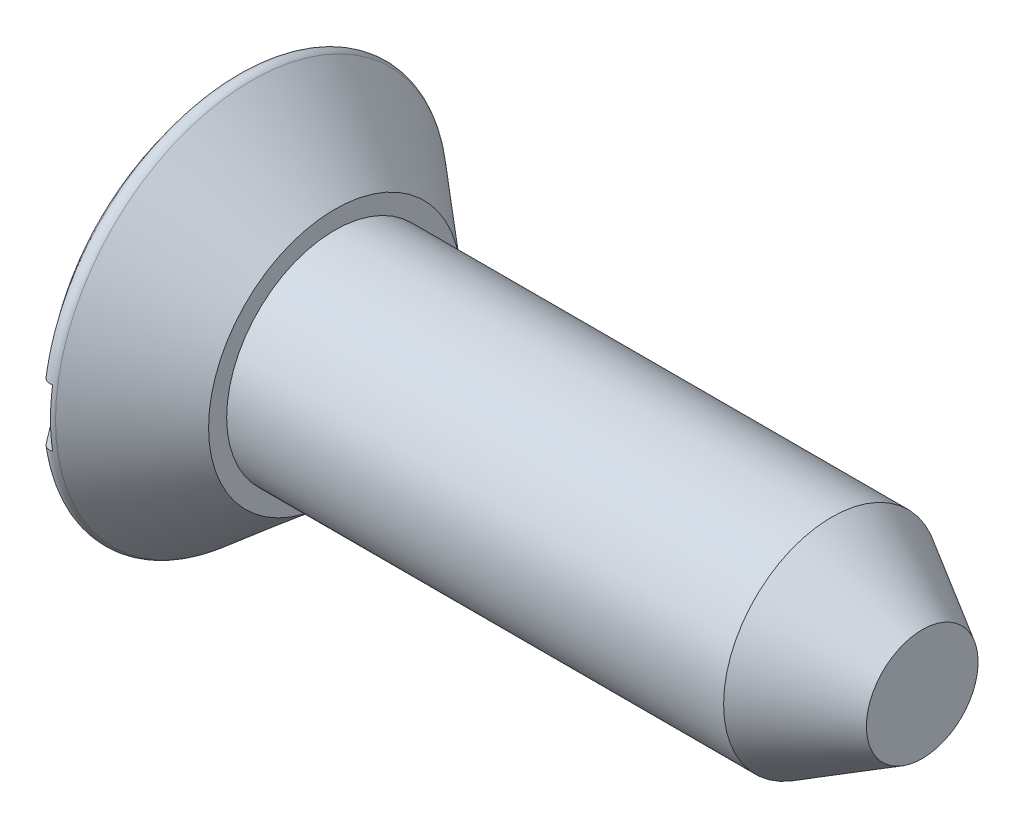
ISO-10303-21;
HEADER;
FILE_DESCRIPTION(('STEP AP214'),'2;1');
FILE_NAME('part.step','',(''),(''),'','','');
FILE_SCHEMA(('AUTOMOTIVE_DESIGN { 1 0 10303 214 1 1 1 1 }'));
ENDSEC;
DATA;
#1=APPLICATION_CONTEXT('core data for automotive mechanical design processes');
#2=APPLICATION_PROTOCOL_DEFINITION('international standard','automotive_design',2000,#1);
#3=PRODUCT_CONTEXT('',#1,'mechanical');
#4=PRODUCT('Part','Part','',(#3));
#5=PRODUCT_RELATED_PRODUCT_CATEGORY('part','',(#4));
#6=PRODUCT_DEFINITION_FORMATION('','',#4);
#7=PRODUCT_DEFINITION_CONTEXT('part definition',#1,'design');
#8=PRODUCT_DEFINITION('design','',#6,#7);
#9=PRODUCT_DEFINITION_SHAPE('','',#8);
#10=(LENGTH_UNIT() NAMED_UNIT(*) SI_UNIT(.MILLI.,.METRE.));
#11=(NAMED_UNIT(*) PLANE_ANGLE_UNIT() SI_UNIT($,.RADIAN.));
#12=(NAMED_UNIT(*) SI_UNIT($,.STERADIAN.) SOLID_ANGLE_UNIT());
#13=UNCERTAINTY_MEASURE_WITH_UNIT(LENGTH_MEASURE(1.E-05),#10,'distance_accuracy_value','');
#14=(GEOMETRIC_REPRESENTATION_CONTEXT(3) GLOBAL_UNCERTAINTY_ASSIGNED_CONTEXT((#13)) GLOBAL_UNIT_ASSIGNED_CONTEXT((#10,
#11,#12)) REPRESENTATION_CONTEXT('',''));
#15=CARTESIAN_POINT('',(0.,0.,0.));
#16=DIRECTION('',(0.,0.,1.));
#17=DIRECTION('',(1.,0.,0.));
#18=AXIS2_PLACEMENT_3D('',#15,#16,#17);
#19=CARTESIAN_POINT('',(0.,0.,0.));
#20=DIRECTION('',(-1.,0.,0.));
#21=DIRECTION('',(0.,0.,1.));
#22=AXIS2_PLACEMENT_3D('',#19,#20,#21);
#23=CYLINDRICAL_SURFACE('',#22,0.762);
#24=CARTESIAN_POINT('',(0.635,0.,0.));
#25=DIRECTION('',(-1.,0.,0.));
#26=DIRECTION('',(0.,0.,1.));
#27=AXIS2_PLACEMENT_3D('',#24,#25,#26);
#28=CIRCLE('',#27,0.762);
#29=CARTESIAN_POINT('',(0.635,0.,0.762));
#30=VERTEX_POINT('',#29);
#31=EDGE_CURVE('E164',#30,#30,#28,.T.);
#32=ORIENTED_EDGE('',*,*,#31,.F.);
#33=EDGE_LOOP('',(#32));
#34=FACE_BOUND('',#33,.T.);
#35=CARTESIAN_POINT('',(4.13728568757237,0.,0.));
#36=DIRECTION('',(-1.,0.,0.));
#37=DIRECTION('',(0.,0.,1.));
#38=AXIS2_PLACEMENT_3D('',#35,#36,#37);
#39=CIRCLE('',#38,0.762);
#40=CARTESIAN_POINT('',(4.13728568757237,0.,0.762));
#41=VERTEX_POINT('',#40);
#42=EDGE_CURVE('E194',#41,#41,#39,.T.);
#43=ORIENTED_EDGE('',*,*,#42,.T.);
#44=EDGE_LOOP('',(#43));
#45=FACE_BOUND('',#44,.T.);
#46=ADVANCED_FACE('F76',(#34,#45),#23,.T.);
#47=CARTESIAN_POINT('',(1.62983333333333,0.,0.));
#48=DIRECTION('',(-1.,0.,0.));
#49=DIRECTION('',(0.,1.,0.));
#50=AXIS2_PLACEMENT_3D('',#47,#48,#49);
#51=SPHERICAL_SURFACE('',#50,2.16323333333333);
#52=CARTESIAN_POINT('',(-0.0414603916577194,0.,0.));
#53=DIRECTION('',(-1.,0.,0.));
#54=DIRECTION('',(0.,0.,1.));
#55=AXIS2_PLACEMENT_3D('',#52,#53,#54);
#56=CIRCLE('',#55,1.37344666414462);
#57=CARTESIAN_POINT('',(-0.0414603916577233,0.2032,1.35833188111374));
#58=VERTEX_POINT('',#57);
#59=CARTESIAN_POINT('',(-0.0414603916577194,0.2032,-1.35833188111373));
#60=VERTEX_POINT('',#59);
#61=EDGE_CURVE('E174',#58,#60,#56,.T.);
#62=ORIENTED_EDGE('',*,*,#61,.T.);
#63=CARTESIAN_POINT('',(1.62983333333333,0.2032,0.));
#64=DIRECTION('',(0.,1.,0.));
#65=DIRECTION('',(0.,0.,1.));
#66=AXIS2_PLACEMENT_3D('',#63,#64,#65);
#67=CIRCLE('',#66,2.15366854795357);
#68=EDGE_CURVE('E104',#60,#58,#67,.T.);
#69=ORIENTED_EDGE('',*,*,#68,.T.);
#70=EDGE_LOOP('',(#62,#69));
#71=FACE_BOUND('',#70,.T.);
#72=ADVANCED_FACE('F190',(#71),#51,.T.);
#73=CARTESIAN_POINT('',(-0.0414603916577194,-0.2032,-1.35833188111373));
#74=VERTEX_POINT('',#73);
#75=CARTESIAN_POINT('',(-0.0414603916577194,-0.2032,1.35833188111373));
#76=VERTEX_POINT('',#75);
#77=EDGE_CURVE('E141',#74,#76,#56,.T.);
#78=ORIENTED_EDGE('',*,*,#77,.T.);
#79=CARTESIAN_POINT('',(1.62983333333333,-0.2032,0.));
#80=DIRECTION('',(0.,-1.,0.));
#81=DIRECTION('',(0.,0.,-1.));
#82=AXIS2_PLACEMENT_3D('',#79,#80,#81);
#83=CIRCLE('',#82,2.15366854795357);
#84=EDGE_CURVE('E96',#76,#74,#83,.T.);
#85=ORIENTED_EDGE('',*,*,#84,.T.);
#86=EDGE_LOOP('',(#78,#85));
#87=FACE_BOUND('',#86,.T.);
#88=ADVANCED_FACE('F78',(#87),#51,.T.);
#89=CARTESIAN_POINT('',(0.635,0.889571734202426,0.));
#90=DIRECTION('',(-1.,0.,0.));
#91=DIRECTION('',(0.,0.,1.));
#92=AXIS2_PLACEMENT_3D('',#89,#90,#91);
#93=PLANE('',#92);
#94=CARTESIAN_POINT('',(0.635,0.,0.));
#95=DIRECTION('',(-1.,0.,0.));
#96=DIRECTION('',(0.,0.,1.));
#97=AXIS2_PLACEMENT_3D('',#94,#95,#96);
#98=CIRCLE('',#97,0.889571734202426);
#99=CARTESIAN_POINT('',(0.635,0.,0.889571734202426));
#100=VERTEX_POINT('',#99);
#101=EDGE_CURVE('E179',#100,#100,#98,.T.);
#102=ORIENTED_EDGE('',*,*,#101,.F.);
#103=EDGE_LOOP('',(#102));
#104=FACE_BOUND('',#103,.T.);
#105=ORIENTED_EDGE('',*,*,#31,.T.);
#106=EDGE_LOOP('',(#105));
#107=FACE_BOUND('',#106,.T.);
#108=ADVANCED_FACE('F186',(#104,#107),#93,.F.);
#109=CARTESIAN_POINT('',(0.635,0.,0.));
#110=DIRECTION('',(-1.,0.,0.));
#111=DIRECTION('',(0.,0.,1.));
#112=AXIS2_PLACEMENT_3D('',#109,#110,#111);
#113=CONICAL_SURFACE('',#112,0.889571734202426,0.698131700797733);
#114=CARTESIAN_POINT('',(0.0484161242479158,0.,0.));
#115=DIRECTION('',(-1.,0.,0.));
#116=DIRECTION('',(0.,0.,1.));
#117=AXIS2_PLACEMENT_3D('',#114,#115,#116);
#118=CIRCLE('',#117,1.38177404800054);
#119=CARTESIAN_POINT('',(0.0484161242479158,0.,1.38177404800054));
#120=VERTEX_POINT('',#119);
#121=EDGE_CURVE('E177',#120,#120,#118,.T.);
#122=ORIENTED_EDGE('',*,*,#121,.F.);
#123=EDGE_LOOP('',(#122));
#124=FACE_BOUND('',#123,.T.);
#125=ORIENTED_EDGE('',*,*,#101,.T.);
#126=EDGE_LOOP('',(#125));
#127=FACE_BOUND('',#126,.T.);
#128=ADVANCED_FACE('F208',(#124,#127),#113,.T.);
#129=CARTESIAN_POINT('',(0.00759911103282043,0.,0.));
#130=DIRECTION('',(-1.,0.,0.));
#131=DIRECTION('',(0.,0.,1.));
#132=AXIS2_PLACEMENT_3D('',#129,#130,#131);
#133=TOROIDAL_SURFACE('',#132,1.33313022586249,0.0635000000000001);
#134=CARTESIAN_POINT('',(0.0253999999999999,0.,0.));
#135=DIRECTION('',(1.,0.,0.));
#136=DIRECTION('',(0.,0.,-1.));
#137=AXIS2_PLACEMENT_3D('',#134,#135,#136);
#138=CIRCLE('',#137,1.39408412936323);
#139=CARTESIAN_POINT('',(0.0253999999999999,-0.2032,-1.37919553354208));
#140=VERTEX_POINT('',#139);
#141=CARTESIAN_POINT('',(0.0253999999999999,0.2032,-1.37919553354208));
#142=VERTEX_POINT('',#141);
#143=EDGE_CURVE('E89',#140,#142,#138,.T.);
#144=ORIENTED_EDGE('',*,*,#143,.T.);
#145=CARTESIAN_POINT('',(-0.0280765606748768,0.2032,-1.37068105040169));
#146=CARTESIAN_POINT('',(-0.0310388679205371,0.2032,-1.36864704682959));
#147=CARTESIAN_POINT('',(-0.0338302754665,0.2032,-1.36635921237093));
#148=CARTESIAN_POINT('',(-0.0389903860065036,0.2032,-1.36134417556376));
#149=CARTESIAN_POINT('',(-0.0413585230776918,0.2032,-1.35861639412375));
#150=CARTESIAN_POINT('',(-0.0456025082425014,0.2032,-1.35280526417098));
#151=CARTESIAN_POINT('',(-0.0474788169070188,0.2032,-1.34972225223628));
#152=CARTESIAN_POINT('',(-0.0506912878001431,0.2032,-1.34328786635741));
#153=CARTESIAN_POINT('',(-0.0520275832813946,0.2032,-1.3399365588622));
#154=CARTESIAN_POINT('',(-0.0541344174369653,0.2032,-1.33303161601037));
#155=CARTESIAN_POINT('',(-0.0549004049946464,0.2032,-1.32947659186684));
#156=CARTESIAN_POINT('',(-0.0558294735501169,0.2032,-1.32228842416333));
#157=CARTESIAN_POINT('',(-0.0559925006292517,0.2032,-1.31865527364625));
#158=CARTESIAN_POINT('',(-0.0557106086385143,0.2032,-1.31138620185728));
#159=CARTESIAN_POINT('',(-0.0552612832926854,0.2032,-1.30775045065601));
#160=CARTESIAN_POINT('',(-0.0537590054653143,0.2032,-1.30060577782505));
#161=CARTESIAN_POINT('',(-0.0527060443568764,0.2032,-1.29709685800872));
#162=CARTESIAN_POINT('',(-0.0500240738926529,0.2032,-1.2903045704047));
#163=CARTESIAN_POINT('',(-0.0483948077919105,0.2032,-1.28702130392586));
#164=CARTESIAN_POINT('',(-0.0446044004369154,0.2032,-1.28077753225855));
#165=CARTESIAN_POINT('',(-0.0424432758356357,0.2032,-1.27781701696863));
#166=CARTESIAN_POINT('',(-0.0376660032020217,0.2032,-1.27232642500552));
#167=CARTESIAN_POINT('',(-0.0350532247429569,0.2032,-1.26979341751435));
#168=CARTESIAN_POINT('',(-0.029435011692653,0.2032,-1.26520842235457));
#169=CARTESIAN_POINT('',(-0.0264296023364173,0.2032,-1.26315640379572));
#170=CARTESIAN_POINT('',(-0.0201498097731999,0.2032,-1.25961788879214));
#171=CARTESIAN_POINT('',(-0.0168790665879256,0.2032,-1.2581249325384));
#172=CARTESIAN_POINT('',(-0.0101314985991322,0.2032,-1.25571637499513));
#173=CARTESIAN_POINT('',(-0.00665468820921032,0.2032,-1.2548007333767));
#174=CARTESIAN_POINT('',(0.000364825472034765,0.2032,-1.25358223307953));
#175=CARTESIAN_POINT('',(0.00390636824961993,0.2032,-1.25327268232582));
#176=CARTESIAN_POINT('',(0.0109908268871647,0.2032,-1.2532556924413));
#177=CARTESIAN_POINT('',(0.0145337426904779,0.2032,-1.25354823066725));
#178=CARTESIAN_POINT('',(0.0215028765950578,0.2032,-1.25472350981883));
#179=CARTESIAN_POINT('',(0.024929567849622,0.2032,-1.25560344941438));
#180=CARTESIAN_POINT('',(0.0315874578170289,0.2032,-1.2579239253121));
#181=CARTESIAN_POINT('',(0.0348186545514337,0.2032,-1.25936446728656));
#182=CARTESIAN_POINT('',(0.0410084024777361,0.2032,-1.26276984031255));
#183=CARTESIAN_POINT('',(0.0439658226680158,0.2032,-1.26473672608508));
#184=CARTESIAN_POINT('',(0.0495129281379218,0.2032,-1.26913422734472));
#185=CARTESIAN_POINT('',(0.0521025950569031,0.2032,-1.2715648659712));
#186=CARTESIAN_POINT('',(0.0568703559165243,0.2032,-1.27684798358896));
#187=CARTESIAN_POINT('',(0.0590438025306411,0.2032,-1.27970465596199));
#188=CARTESIAN_POINT('',(0.0628870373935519,0.2032,-1.28573874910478));
#189=CARTESIAN_POINT('',(0.0645567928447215,0.2032,-1.28891619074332));
#190=CARTESIAN_POINT('',(0.0673659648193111,0.2032,-1.29554283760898));
#191=CARTESIAN_POINT('',(0.0684987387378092,0.2032,-1.29899485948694));
#192=CARTESIAN_POINT('',(0.0701738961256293,0.2032,-1.30603933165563));
#193=CARTESIAN_POINT('',(0.0707162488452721,0.2032,-1.30963178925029));
#194=CARTESIAN_POINT('',(0.0711980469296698,0.2032,-1.31688608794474));
#195=CARTESIAN_POINT('',(0.0711326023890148,0.2032,-1.32054825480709));
#196=CARTESIAN_POINT('',(0.0703883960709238,0.2032,-1.32780981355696));
#197=CARTESIAN_POINT('',(0.0697096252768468,0.2032,-1.33140920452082));
#198=CARTESIAN_POINT('',(0.0677556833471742,0.2032,-1.33844529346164));
#199=CARTESIAN_POINT('',(0.0664800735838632,0.2032,-1.34188186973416));
#200=CARTESIAN_POINT('',(0.0633663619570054,0.2032,-1.34849009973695));
#201=CARTESIAN_POINT('',(0.0615282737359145,0.2032,-1.35166175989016));
#202=CARTESIAN_POINT('',(0.0573534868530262,0.2032,-1.35762753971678));
#203=CARTESIAN_POINT('',(0.0550200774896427,0.2032,-1.36042396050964));
#204=CARTESIAN_POINT('',(0.0499123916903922,0.2032,-1.36558019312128));
#205=CARTESIAN_POINT('',(0.0471381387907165,0.2032,-1.36794002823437));
#206=CARTESIAN_POINT('',(0.041258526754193,0.2032,-1.37212965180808));
#207=CARTESIAN_POINT('',(0.0381569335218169,0.2032,-1.37396472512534));
#208=CARTESIAN_POINT('',(0.0316874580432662,0.2032,-1.37708192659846));
#209=CARTESIAN_POINT('',(0.0283196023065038,0.2032,-1.3783641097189));
#210=CARTESIAN_POINT('',(0.0214497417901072,0.2032,-1.38032643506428));
#211=CARTESIAN_POINT('',(0.0179494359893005,0.2032,-1.38101252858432));
#212=CARTESIAN_POINT('',(0.0108822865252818,0.2032,-1.38178380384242));
#213=CARTESIAN_POINT('',(0.00731542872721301,0.2032,-1.38186885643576));
#214=CARTESIAN_POINT('',(0.00023700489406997,0.2032,-1.38143643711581));
#215=CARTESIAN_POINT('',(-0.00327474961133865,0.2032,-1.38092201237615));
#216=CARTESIAN_POINT('',(-0.0101589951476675,0.2032,-1.37931130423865));
#217=CARTESIAN_POINT('',(-0.0135316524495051,0.2032,-1.37821573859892));
#218=CARTESIAN_POINT('',(-0.0187672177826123,0.2032,-1.37601485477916));
#219=CARTESIAN_POINT('',(-0.0207041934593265,0.2032,-1.37508132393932));
#220=CARTESIAN_POINT('',(-0.0244733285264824,0.2032,-1.3730224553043));
#221=CARTESIAN_POINT('',(-0.0263054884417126,0.2032,-1.37189711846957));
#222=CARTESIAN_POINT('',(-0.0280765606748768,0.2032,-1.37068105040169));
#223=B_SPLINE_CURVE_WITH_KNOTS('',3,(#145,#146,#147,#148,#149,#150,#151,#152,#153,#154,#155,
#156,#157,#158,#159,#160,#161,#162,#163,#164,#165,#166,#167,#168,#169,#170,#171,#172,#173,#174,
#175,#176,#177,#178,#179,#180,#181,#182,#183,#184,#185,#186,#187,#188,#189,#190,#191,#192,#193,
#194,#195,#196,#197,#198,#199,#200,#201,#202,#203,#204,#205,#206,#207,#208,#209,#210,#211,#212,
#213,#214,#215,#216,#217,#218,#219,#220,#221,#222),.UNSPECIFIED.,.T.,.F.,(4,2,2,2,2,2,2,2,2,2,2,
2,2,2,2,2,2,2,2,2,2,2,2,2,2,2,2,2,2,2,2,2,2,2,2,2,2,2,4),(0.,0.0107722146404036,
0.021558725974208,0.0323350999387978,0.0431088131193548,0.0539676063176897,0.0648273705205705,
0.0757656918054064,0.0867041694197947,0.0976475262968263,0.108590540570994,0.119455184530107,
0.130319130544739,0.141053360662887,0.151786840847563,0.162401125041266,0.173015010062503,
0.18357863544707,0.194142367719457,0.204747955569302,0.215354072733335,0.226072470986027,
0.236791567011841,0.247640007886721,0.258489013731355,0.26942537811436,0.280361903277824,
0.291306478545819,0.302250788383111,0.313124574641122,0.323997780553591,0.334757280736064,
0.34551571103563,0.356165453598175,0.366817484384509,0.377415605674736,0.388000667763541,
0.394441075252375,0.40088145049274),.UNSPECIFIED.);
#224=EDGE_CURVE('E49',#142,#60,#223,.T.);
#225=ORIENTED_EDGE('',*,*,#224,.T.);
#226=ORIENTED_EDGE('',*,*,#61,.F.);
#227=CARTESIAN_POINT('',(0.00947622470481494,0.2032,1.25329211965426));
#228=CARTESIAN_POINT('',(0.00594649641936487,0.2032,1.25318653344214));
#229=CARTESIAN_POINT('',(0.00240523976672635,0.2032,1.2533798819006));
#230=CARTESIAN_POINT('',(-0.00459708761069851,0.2032,1.25435998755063));
#231=CARTESIAN_POINT('',(-0.00805805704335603,0.2032,1.25514745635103));
#232=CARTESIAN_POINT('',(-0.0147964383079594,0.2032,1.257291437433));
#233=CARTESIAN_POINT('',(-0.0180739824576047,0.2032,1.25864753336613));
#234=CARTESIAN_POINT('',(-0.0243556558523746,0.2032,1.26188748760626));
#235=CARTESIAN_POINT('',(-0.0273598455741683,0.2032,1.26377122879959));
#236=CARTESIAN_POINT('',(-0.0330294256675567,0.2032,1.26802277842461));
#237=CARTESIAN_POINT('',(-0.0356928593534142,0.2032,1.27039319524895));
#238=CARTESIAN_POINT('',(-0.0405898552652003,0.2032,1.27554288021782));
#239=CARTESIAN_POINT('',(-0.0428233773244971,0.2032,1.27832218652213));
#240=CARTESIAN_POINT('',(-0.0468253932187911,0.2032,1.28424605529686));
#241=CARTESIAN_POINT('',(-0.048588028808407,0.2032,1.28739457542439));
#242=CARTESIAN_POINT('',(-0.0515663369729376,0.2032,1.29394046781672));
#243=CARTESIAN_POINT('',(-0.0527819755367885,0.2032,1.29733785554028));
#244=CARTESIAN_POINT('',(-0.0546447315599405,0.2032,1.30432511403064));
#245=CARTESIAN_POINT('',(-0.0552854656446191,0.2032,1.30791668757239));
#246=CARTESIAN_POINT('',(-0.0559583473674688,0.2032,1.31515644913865));
#247=CARTESIAN_POINT('',(-0.0559904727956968,0.2032,1.3188046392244));
#248=CARTESIAN_POINT('',(-0.0554434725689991,0.2032,1.32607408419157));
#249=CARTESIAN_POINT('',(-0.0548611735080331,0.2032,1.32969510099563));
#250=CARTESIAN_POINT('',(-0.0530954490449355,0.2032,1.33678758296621));
#251=CARTESIAN_POINT('',(-0.0519120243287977,0.2032,1.34025904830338));
#252=CARTESIAN_POINT('',(-0.0489792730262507,0.2032,1.34694386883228));
#253=CARTESIAN_POINT('',(-0.0472313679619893,0.2032,1.35015784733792));
#254=CARTESIAN_POINT('',(-0.0432163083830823,0.2032,1.35624332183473));
#255=CARTESIAN_POINT('',(-0.0409491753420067,0.2032,1.35911483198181));
#256=CARTESIAN_POINT('',(-0.0359804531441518,0.2032,1.36440678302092));
#257=CARTESIAN_POINT('',(-0.0332827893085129,0.2032,1.36683090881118));
#258=CARTESIAN_POINT('',(-0.0275149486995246,0.2032,1.37118587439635));
#259=CARTESIAN_POINT('',(-0.0244447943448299,0.2032,1.37311674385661));
#260=CARTESIAN_POINT('',(-0.0180548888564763,0.2032,1.37640840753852));
#261=CARTESIAN_POINT('',(-0.0147382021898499,0.2032,1.37777515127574));
#262=CARTESIAN_POINT('',(-0.00792123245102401,0.2032,1.37992697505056));
#263=CARTESIAN_POINT('',(-0.00442095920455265,0.2032,1.38071208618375));
#264=CARTESIAN_POINT('',(0.00263179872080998,0.2032,1.38167253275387));
#265=CARTESIAN_POINT('',(0.00618358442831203,0.2032,1.38185300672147));
#266=CARTESIAN_POINT('',(0.0132667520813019,0.2032,1.38161315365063));
#267=CARTESIAN_POINT('',(0.016798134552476,0.2032,1.38119284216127));
#268=CARTESIAN_POINT('',(0.0237296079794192,0.2032,1.37976626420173));
#269=CARTESIAN_POINT('',(0.0271300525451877,0.2032,1.37876171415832));
#270=CARTESIAN_POINT('',(0.0337149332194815,0.2032,1.37619803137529));
#271=CARTESIAN_POINT('',(0.0368993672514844,0.2032,1.37463889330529));
#272=CARTESIAN_POINT('',(0.0429751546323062,0.2032,1.37100526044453));
#273=CARTESIAN_POINT('',(0.0458653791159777,0.2032,1.36892887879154));
#274=CARTESIAN_POINT('',(0.0512601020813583,0.2032,1.364324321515));
#275=CARTESIAN_POINT('',(0.0537645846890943,0.2032,1.36179612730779));
#276=CARTESIAN_POINT('',(0.0583409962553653,0.2032,1.35633601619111));
#277=CARTESIAN_POINT('',(0.0604088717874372,0.2032,1.35340070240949));
#278=CARTESIAN_POINT('',(0.0640286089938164,0.2032,1.34722755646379));
#279=CARTESIAN_POINT('',(0.0655804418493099,0.2032,1.34398970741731));
#280=CARTESIAN_POINT('',(0.0681413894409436,0.2032,1.3372661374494));
#281=CARTESIAN_POINT('',(0.06914449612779,0.2032,1.33377812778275));
#282=CARTESIAN_POINT('',(0.0705562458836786,0.2032,1.32668378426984));
#283=CARTESIAN_POINT('',(0.0709648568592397,0.2032,1.32307744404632));
#284=CARTESIAN_POINT('',(0.0711781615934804,0.2032,1.31581706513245));
#285=CARTESIAN_POINT('',(0.0709778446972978,0.2032,1.31216287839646));
#286=CARTESIAN_POINT('',(0.0699679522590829,0.2032,1.30493959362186));
#287=CARTESIAN_POINT('',(0.0691583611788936,0.2032,1.30137049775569));
#288=CARTESIAN_POINT('',(0.0669493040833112,0.2032,1.29441170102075));
#289=CARTESIAN_POINT('',(0.0655486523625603,0.2032,1.29102237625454));
#290=CARTESIAN_POINT('',(0.0621951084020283,0.2032,1.28452895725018));
#291=CARTESIAN_POINT('',(0.0602422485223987,0.2032,1.28142484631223));
#292=CARTESIAN_POINT('',(0.0558506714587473,0.2032,1.27561016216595));
#293=CARTESIAN_POINT('',(0.053414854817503,0.2032,1.27289739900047));
#294=CARTESIAN_POINT('',(0.0481169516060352,0.2032,1.26792439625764));
#295=CARTESIAN_POINT('',(0.0452547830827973,0.2032,1.265664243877));
#296=CARTESIAN_POINT('',(0.0392195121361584,0.2032,1.26168837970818));
#297=CARTESIAN_POINT('',(0.0360501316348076,0.2032,1.25996701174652));
#298=CARTESIAN_POINT('',(0.0294673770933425,0.2032,1.25709012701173));
#299=CARTESIAN_POINT('',(0.026054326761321,0.2032,1.2559338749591));
#300=CARTESIAN_POINT('',(0.0204268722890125,0.2032,1.25455054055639));
#301=CARTESIAN_POINT('',(0.0182565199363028,0.2032,1.2541371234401));
#302=CARTESIAN_POINT('',(0.0138843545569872,0.2032,1.25354091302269));
#303=CARTESIAN_POINT('',(0.0116825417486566,0.2032,1.25335811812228));
#304=CARTESIAN_POINT('',(0.00947622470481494,0.2032,1.25329211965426));
#305=B_SPLINE_CURVE_WITH_KNOTS('',3,(#227,#228,#229,#230,#231,#232,#233,#234,#235,#236,#237,
#238,#239,#240,#241,#242,#243,#244,#245,#246,#247,#248,#249,#250,#251,#252,#253,#254,#255,#256,
#257,#258,#259,#260,#261,#262,#263,#264,#265,#266,#267,#268,#269,#270,#271,#272,#273,#274,#275,
#276,#277,#278,#279,#280,#281,#282,#283,#284,#285,#286,#287,#288,#289,#290,#291,#292,#293,#294,
#295,#296,#297,#298,#299,#300,#301,#302,#303,#304),.UNSPECIFIED.,.T.,.F.,(4,2,2,2,2,2,2,2,2,2,2,
2,2,2,2,2,2,2,2,2,2,2,2,2,2,2,2,2,2,2,2,2,2,2,2,2,2,2,4),(0.,0.0105858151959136,
0.0211843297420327,0.0317750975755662,0.0423635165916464,0.0530102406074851,0.0636579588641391,
0.0744325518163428,0.0852078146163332,0.0961012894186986,0.10699516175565,0.117945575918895,
0.128895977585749,0.139819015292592,0.150741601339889,0.161569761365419,0.172397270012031,
0.183107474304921,0.193817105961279,0.204435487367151,0.215053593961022,0.225640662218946,
0.23622783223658,0.246854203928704,0.257481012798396,0.268202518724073,0.278924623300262,
0.289761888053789,0.300599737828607,0.311527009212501,0.322454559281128,0.333404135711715,
0.344353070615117,0.355238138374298,0.366125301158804,0.376894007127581,0.38764866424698,
0.39426555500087,0.400882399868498),.UNSPECIFIED.);
#306=CARTESIAN_POINT('',(0.0253999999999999,0.2032,1.37919553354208));
#307=VERTEX_POINT('',#306);
#308=EDGE_CURVE('E142',#58,#307,#305,.T.);
#309=ORIENTED_EDGE('',*,*,#308,.T.);
#310=CARTESIAN_POINT('',(0.0253999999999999,-0.2032,1.37919553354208));
#311=VERTEX_POINT('',#310);
#312=EDGE_CURVE('E132',#307,#311,#138,.T.);
#313=ORIENTED_EDGE('',*,*,#312,.T.);
#314=CARTESIAN_POINT('',(0.00947622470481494,-0.2032,1.25329211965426));
#315=CARTESIAN_POINT('',(0.0130099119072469,-0.2032,1.25339815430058));
#316=CARTESIAN_POINT('',(0.0165372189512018,-0.2032,1.25380395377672));
#317=CARTESIAN_POINT('',(0.0234760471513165,-0.2032,1.25520394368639));
#318=CARTESIAN_POINT('',(0.0268874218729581,-0.2032,1.25619885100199));
#319=CARTESIAN_POINT('',(0.0334924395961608,-0.2032,1.25874602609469));
#320=CARTESIAN_POINT('',(0.0366862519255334,-0.2032,1.26029785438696));
#321=CARTESIAN_POINT('',(0.0427692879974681,-0.2032,1.2639120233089));
#322=CARTESIAN_POINT('',(0.0456585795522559,-0.2032,1.26597424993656));
#323=CARTESIAN_POINT('',(0.0510724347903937,-0.2032,1.27056361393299));
#324=CARTESIAN_POINT('',(0.0535945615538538,-0.2032,1.27309362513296));
#325=CARTESIAN_POINT('',(0.0581845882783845,-0.2032,1.278536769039));
#326=CARTESIAN_POINT('',(0.0602524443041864,-0.2032,1.28144993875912));
#327=CARTESIAN_POINT('',(0.063901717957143,-0.2032,1.28761462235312));
#328=CARTESIAN_POINT('',(0.0654769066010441,-0.2032,1.29086982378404));
#329=CARTESIAN_POINT('',(0.0680647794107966,-0.2032,1.29759663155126));
#330=CARTESIAN_POINT('',(0.0690774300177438,-0.2032,1.30106825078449));
#331=CARTESIAN_POINT('',(0.0705210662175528,-0.2032,1.30816748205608));
#332=CARTESIAN_POINT('',(0.0709459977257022,-0.2032,1.31179632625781));
#333=CARTESIAN_POINT('',(0.0711832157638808,-0.2032,1.31907404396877));
#334=CARTESIAN_POINT('',(0.0709954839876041,-0.2032,1.32272291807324));
#335=CARTESIAN_POINT('',(0.0700099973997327,-0.2032,1.32995179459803));
#336=CARTESIAN_POINT('',(0.0692098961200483,-0.2032,1.33353147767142));
#337=CARTESIAN_POINT('',(0.0670178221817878,-0.2032,1.34050489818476));
#338=CARTESIAN_POINT('',(0.0656258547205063,-0.2032,1.34389863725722));
#339=CARTESIAN_POINT('',(0.0622938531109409,-0.2032,1.35038926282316));
#340=CARTESIAN_POINT('',(0.0603559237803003,-0.2032,1.35348722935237));
#341=CARTESIAN_POINT('',(0.0559828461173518,-0.2032,1.35930982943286));
#342=CARTESIAN_POINT('',(0.0535477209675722,-0.2032,1.36203448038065));
#343=CARTESIAN_POINT('',(0.0482734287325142,-0.2032,1.36700540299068));
#344=CARTESIAN_POINT('',(0.0454382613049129,-0.2032,1.36925591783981));
#345=CARTESIAN_POINT('',(0.0394269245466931,-0.2032,1.37324287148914));
#346=CARTESIAN_POINT('',(0.0362507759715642,-0.2032,1.37497934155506));
#347=CARTESIAN_POINT('',(0.029684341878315,-0.2032,1.3778695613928));
#348=CARTESIAN_POINT('',(0.0262967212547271,-0.2032,1.37902936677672));
#349=CARTESIAN_POINT('',(0.0193740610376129,-0.2032,1.38075880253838));
#350=CARTESIAN_POINT('',(0.0158390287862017,-0.2032,1.38132846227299));
#351=CARTESIAN_POINT('',(0.00875106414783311,-0.2032,1.38185818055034));
#352=CARTESIAN_POINT('',(0.00519847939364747,-0.2032,1.3818229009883));
#353=CARTESIAN_POINT('',(-0.00185006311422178,-0.2032,1.38115523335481));
#354=CARTESIAN_POINT('',(-0.00534602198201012,-0.2032,1.38052285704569));
#355=CARTESIAN_POINT('',(-0.0121760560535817,-0.2032,1.3786816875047));
#356=CARTESIAN_POINT('',(-0.0155104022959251,-0.2032,1.37747389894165));
#357=CARTESIAN_POINT('',(-0.0219303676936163,-0.2032,1.37451827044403));
#358=CARTESIAN_POINT('',(-0.0250159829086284,-0.2032,1.37277042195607));
#359=CARTESIAN_POINT('',(-0.0308674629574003,-0.2032,1.36877631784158));
#360=CARTESIAN_POINT('',(-0.0336317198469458,-0.2032,1.36652770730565));
#361=CARTESIAN_POINT('',(-0.0387479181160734,-0.2032,1.36160230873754));
#362=CARTESIAN_POINT('',(-0.0410998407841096,-0.2032,1.35892550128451));
#363=CARTESIAN_POINT('',(-0.0453488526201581,-0.2032,1.35319269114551));
#364=CARTESIAN_POINT('',(-0.0472413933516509,-0.2032,1.35013331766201));
#365=CARTESIAN_POINT('',(-0.0504922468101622,-0.2032,1.34374284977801));
#366=CARTESIAN_POINT('',(-0.0518505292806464,-0.2032,1.34041174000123));
#367=CARTESIAN_POINT('',(-0.0540090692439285,-0.2032,1.33353443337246));
#368=CARTESIAN_POINT('',(-0.0548032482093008,-0.2032,1.32998632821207));
#369=CARTESIAN_POINT('',(-0.0557894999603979,-0.2032,1.32280735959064));
#370=CARTESIAN_POINT('',(-0.0559815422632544,-0.2032,1.31917649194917));
#371=CARTESIAN_POINT('',(-0.0557579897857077,-0.2032,1.31190663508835));
#372=CARTESIAN_POINT('',(-0.0553379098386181,-0.2032,1.3082677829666));
#373=CARTESIAN_POINT('',(-0.0538933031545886,-0.2032,1.30111200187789));
#374=CARTESIAN_POINT('',(-0.0528687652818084,-0.2032,1.29759507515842));
#375=CARTESIAN_POINT('',(-0.0502417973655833,-0.2032,1.29078133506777));
#376=CARTESIAN_POINT('',(-0.0486389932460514,-0.2032,1.28748466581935));
#377=CARTESIAN_POINT('',(-0.0448990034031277,-0.2032,1.2812098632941));
#378=CARTESIAN_POINT('',(-0.0427618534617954,-0.2032,1.27823170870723));
#379=CARTESIAN_POINT('',(-0.0380290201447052,-0.2032,1.27270189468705));
#380=CARTESIAN_POINT('',(-0.0354367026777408,-0.2032,1.27014735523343));
#381=CARTESIAN_POINT('',(-0.0298547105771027,-0.2032,1.26551544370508));
#382=CARTESIAN_POINT('',(-0.0268649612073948,-0.2032,1.2634381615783));
#383=CARTESIAN_POINT('',(-0.0206104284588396,-0.2032,1.25984621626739));
#384=CARTESIAN_POINT('',(-0.0173491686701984,-0.2032,1.25832540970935));
#385=CARTESIAN_POINT('',(-0.0106183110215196,-0.2032,1.25586184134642));
#386=CARTESIAN_POINT('',(-0.00714899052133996,-0.2032,1.25491832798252));
#387=CARTESIAN_POINT('',(-0.00146806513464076,-0.2032,1.25388429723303));
#388=CARTESIAN_POINT('',(0.000710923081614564,-0.2032,1.25360500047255));
#389=CARTESIAN_POINT('',(0.00508616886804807,-0.2032,1.25327599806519));
#390=CARTESIAN_POINT('',(0.00728242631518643,-0.2032,1.25322629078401));
#391=CARTESIAN_POINT('',(0.00947622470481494,-0.2032,1.25329211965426));
#392=B_SPLINE_CURVE_WITH_KNOTS('',3,(#314,#315,#316,#317,#318,#319,#320,#321,#322,#323,#324,
#325,#326,#327,#328,#329,#330,#331,#332,#333,#334,#335,#336,#337,#338,#339,#340,#341,#342,#343,
#344,#345,#346,#347,#348,#349,#350,#351,#352,#353,#354,#355,#356,#357,#358,#359,#360,#361,#362,
#363,#364,#365,#366,#367,#368,#369,#370,#371,#372,#373,#374,#375,#376,#377,#378,#379,#380,#381,
#382,#383,#384,#385,#386,#387,#388,#389,#390,#391),.UNSPECIFIED.,.T.,.F.,(4,2,2,2,2,2,2,2,2,2,2,
2,2,2,2,2,2,2,2,2,2,2,2,2,2,2,2,2,2,2,2,2,2,2,2,2,2,2,4),(0.,0.0105977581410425,
0.0212084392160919,0.0318107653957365,0.0424107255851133,0.0530781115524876,0.0637465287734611,
0.074544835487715,0.0853437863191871,0.0962531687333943,0.107162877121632,0.118114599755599,
0.129066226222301,0.139976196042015,0.15088565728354,0.16169289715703,0.172499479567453,
0.183190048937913,0.193880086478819,0.204487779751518,0.215095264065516,0.225684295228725,
0.236273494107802,0.2469135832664,0.257554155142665,0.268296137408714,0.279038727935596,
0.289895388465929,0.300752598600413,0.311689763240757,0.322627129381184,0.333571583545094,
0.344515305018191,0.355381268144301,0.366249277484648,0.37699340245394,0.3877235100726,
0.394302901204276,0.400882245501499),.UNSPECIFIED.);
#393=EDGE_CURVE('E134',#311,#76,#392,.T.);
#394=ORIENTED_EDGE('',*,*,#393,.T.);
#395=ORIENTED_EDGE('',*,*,#77,.F.);
#396=CARTESIAN_POINT('',(-0.0280765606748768,-0.2032,-1.37068105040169));
#397=CARTESIAN_POINT('',(-0.0251555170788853,-0.2032,-1.37268633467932));
#398=CARTESIAN_POINT('',(-0.0220641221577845,-0.2032,-1.37444776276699));
#399=CARTESIAN_POINT('',(-0.0156272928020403,-0.2032,-1.37742868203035));
#400=CARTESIAN_POINT('',(-0.0122815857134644,-0.2032,-1.37864758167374));
#401=CARTESIAN_POINT('',(-0.00543309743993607,-0.2032,-1.38050488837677));
#402=CARTESIAN_POINT('',(-0.00193034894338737,-0.2032,-1.38114341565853));
#403=CARTESIAN_POINT('',(0.00513179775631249,-0.2032,-1.38182071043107));
#404=CARTESIAN_POINT('',(0.00869118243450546,-0.2032,-1.38185961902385));
#405=CARTESIAN_POINT('',(0.0157530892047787,-0.2032,-1.38133786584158));
#406=CARTESIAN_POINT('',(0.019255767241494,-0.2032,-1.38077931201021));
#407=CARTESIAN_POINT('',(0.02611787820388,-0.2032,-1.37908270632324));
#408=CARTESIAN_POINT('',(0.0294773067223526,-0.2032,-1.37794463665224));
#409=CARTESIAN_POINT('',(0.0359623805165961,-0.2032,-1.37512123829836));
#410=CARTESIAN_POINT('',(0.0390877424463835,-0.2032,-1.37343525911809));
#411=CARTESIAN_POINT('',(0.0450137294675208,-0.2032,-1.36956610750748));
#412=CARTESIAN_POINT('',(0.0478143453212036,-0.2032,-1.36738292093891));
#413=CARTESIAN_POINT('',(0.0530335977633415,-0.2032,-1.36256512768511));
#414=CARTESIAN_POINT('',(0.0554493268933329,-0.2032,-1.35992737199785));
#415=CARTESIAN_POINT('',(0.0598091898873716,-0.2032,-1.35428739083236));
#416=CARTESIAN_POINT('',(0.0617532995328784,-0.2032,-1.35128514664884));
#417=CARTESIAN_POINT('',(0.0651365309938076,-0.2032,-1.34496765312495));
#418=CARTESIAN_POINT('',(0.0665701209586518,-0.2032,-1.34164944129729));
#419=CARTESIAN_POINT('',(0.0688659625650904,-0.2032,-1.33482092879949));
#420=CARTESIAN_POINT('',(0.0697281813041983,-0.2032,-1.33131061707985));
#421=CARTESIAN_POINT('',(0.0708646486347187,-0.2032,-1.32416101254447));
#422=CARTESIAN_POINT('',(0.071133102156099,-0.2032,-1.32052079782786));
#423=CARTESIAN_POINT('',(0.0710582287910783,-0.2032,-1.31324660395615));
#424=CARTESIAN_POINT('',(0.070714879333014,-0.2032,-1.30961262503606));
#425=CARTESIAN_POINT('',(0.0694226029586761,-0.2032,-1.30243610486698));
#426=CARTESIAN_POINT('',(0.0684708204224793,-0.2032,-1.29889407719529));
#427=CARTESIAN_POINT('',(0.0659845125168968,-0.2032,-1.29202069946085));
#428=CARTESIAN_POINT('',(0.0644499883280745,-0.2032,-1.28868934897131));
#429=CARTESIAN_POINT('',(0.0608447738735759,-0.2032,-1.28234287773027));
#430=CARTESIAN_POINT('',(0.0587756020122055,-0.2032,-1.27932689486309));
#431=CARTESIAN_POINT('',(0.054155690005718,-0.2032,-1.27368944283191));
#432=CARTESIAN_POINT('',(0.0516049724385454,-0.2032,-1.27106795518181));
#433=CARTESIAN_POINT('',(0.0461202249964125,-0.2032,-1.26632179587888));
#434=CARTESIAN_POINT('',(0.0431901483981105,-0.2032,-1.26419255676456));
#435=CARTESIAN_POINT('',(0.0370104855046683,-0.2032,-1.26046347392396));
#436=CARTESIAN_POINT('',(0.0337609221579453,-0.2032,-1.25886359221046));
#437=CARTESIAN_POINT('',(0.0270776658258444,-0.2032,-1.25625919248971));
#438=CARTESIAN_POINT('',(0.0236467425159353,-0.2032,-1.25524756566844));
#439=CARTESIAN_POINT('',(0.016663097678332,-0.2032,-1.25382056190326));
#440=CARTESIAN_POINT('',(0.0131103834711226,-0.2032,-1.25340514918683));
#441=CARTESIAN_POINT('',(0.00601823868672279,-0.2032,-1.25318448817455));
#442=CARTESIAN_POINT('',(0.00247897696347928,-0.2032,-1.25337377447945));
#443=CARTESIAN_POINT('',(-0.00451725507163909,-0.2032,-1.25434468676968));
#444=CARTESIAN_POINT('',(-0.00797422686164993,-0.2032,-1.25512630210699));
#445=CARTESIAN_POINT('',(-0.0147041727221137,-0.2032,-1.25725671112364));
#446=CARTESIAN_POINT('',(-0.0179773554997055,-0.2032,-1.25860484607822));
#447=CARTESIAN_POINT('',(-0.0242531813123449,-0.2032,-1.26182770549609));
#448=CARTESIAN_POINT('',(-0.0272558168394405,-0.2032,-1.26370244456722));
#449=CARTESIAN_POINT('',(-0.0329291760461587,-0.2032,-1.26793864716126));
#450=CARTESIAN_POINT('',(-0.0355973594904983,-0.2032,-1.27030351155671));
#451=CARTESIAN_POINT('',(-0.0405046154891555,-0.2032,-1.27544288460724));
#452=CARTESIAN_POINT('',(-0.0427436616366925,-0.2032,-1.27821741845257));
#453=CARTESIAN_POINT('',(-0.0467574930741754,-0.2032,-1.28413264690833));
#454=CARTESIAN_POINT('',(-0.0485264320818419,-0.2032,-1.28727730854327));
#455=CARTESIAN_POINT('',(-0.0515179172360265,-0.2032,-1.29381658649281));
#456=CARTESIAN_POINT('',(-0.0527404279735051,-0.2032,-1.29721121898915));
#457=CARTESIAN_POINT('',(-0.0546174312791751,-0.2032,-1.3041942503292));
#458=CARTESIAN_POINT('',(-0.0552655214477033,-0.2032,-1.30778437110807));
#459=CARTESIAN_POINT('',(-0.0559532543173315,-0.2032,-1.31502234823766));
#460=CARTESIAN_POINT('',(-0.0559928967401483,-0.2032,-1.31867020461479));
#461=CARTESIAN_POINT('',(-0.0554610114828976,-0.2032,-1.32594001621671));
#462=CARTESIAN_POINT('',(-0.0548863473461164,-0.2032,-1.32956174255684));
#463=CARTESIAN_POINT('',(-0.0531354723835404,-0.2032,-1.33665788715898));
#464=CARTESIAN_POINT('',(-0.0519591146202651,-0.2032,-1.34013226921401));
#465=CARTESIAN_POINT('',(-0.0490393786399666,-0.2032,-1.34682557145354));
#466=CARTESIAN_POINT('',(-0.0472971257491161,-0.2032,-1.3500449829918));
#467=CARTESIAN_POINT('',(-0.0432934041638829,-0.2032,-1.35613919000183));
#468=CARTESIAN_POINT('',(-0.0410325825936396,-0.2032,-1.3590144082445));
#469=CARTESIAN_POINT('',(-0.0369701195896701,-0.2032,-1.36335974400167));
#470=CARTESIAN_POINT('',(-0.0353039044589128,-0.2032,-1.36495860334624));
#471=CARTESIAN_POINT('',(-0.031808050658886,-0.2032,-1.36796644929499));
#472=CARTESIAN_POINT('',(-0.0299784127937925,-0.2032,-1.36937543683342));
#473=CARTESIAN_POINT('',(-0.0280765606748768,-0.2032,-1.37068105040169));
#474=B_SPLINE_CURVE_WITH_KNOTS('',3,(#396,#397,#398,#399,#400,#401,#402,#403,#404,#405,#406,
#407,#408,#409,#410,#411,#412,#413,#414,#415,#416,#417,#418,#419,#420,#421,#422,#423,#424,#425,
#426,#427,#428,#429,#430,#431,#432,#433,#434,#435,#436,#437,#438,#439,#440,#441,#442,#443,#444,
#445,#446,#447,#448,#449,#450,#451,#452,#453,#454,#455,#456,#457,#458,#459,#460,#461,#462,#463,
#464,#465,#466,#467,#468,#469,#470,#471,#472,#473),.UNSPECIFIED.,.T.,.F.,(4,2,2,2,2,2,2,2,2,2,2,
2,2,2,2,2,2,2,2,2,2,2,2,2,2,2,2,2,2,2,2,2,2,2,2,2,2,2,4),(0.,0.010621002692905,
0.0212535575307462,0.0318839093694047,0.042511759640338,0.0531022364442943,0.0636930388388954,
0.0742964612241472,0.0849001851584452,0.0955805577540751,0.106261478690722,0.117054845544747,
0.127848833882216,0.138747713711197,0.149646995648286,0.16059781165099,0.171548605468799,
0.182468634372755,0.193388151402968,0.204201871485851,0.215014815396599,0.225694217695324,
0.236372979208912,0.246955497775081,0.257537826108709,0.268107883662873,0.278678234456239,
0.289324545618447,0.299971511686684,0.310745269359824,0.321519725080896,0.332412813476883,
0.343305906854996,0.354254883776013,0.365206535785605,0.376136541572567,0.387052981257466,
0.393968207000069,0.400883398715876),.UNSPECIFIED.);
#475=EDGE_CURVE('E130',#74,#140,#474,.T.);
#476=ORIENTED_EDGE('',*,*,#475,.T.);
#477=EDGE_LOOP('',(#144,#225,#226,#309,#313,#394,#395,#476));
#478=FACE_BOUND('',#477,.T.);
#479=ORIENTED_EDGE('',*,*,#121,.T.);
#480=EDGE_LOOP('',(#479));
#481=FACE_BOUND('',#480,.T.);
#482=ADVANCED_FACE('F138',(#478,#481),#133,.T.);
#483=CARTESIAN_POINT('',(-0.5334,0.2032,-1.39663022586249));
#484=DIRECTION('',(0.,1.,0.));
#485=DIRECTION('',(0.,0.,1.));
#486=AXIS2_PLACEMENT_3D('',#483,#484,#485);
#487=PLANE('',#486);
#488=DIRECTION('',(0.,0.,1.));
#489=VECTOR('',#488,1.);
#490=CARTESIAN_POINT('',(0.0253999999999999,0.2032,-1.39663022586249));
#491=LINE('',#490,#489);
#492=EDGE_CURVE('E127',#142,#307,#491,.T.);
#493=ORIENTED_EDGE('',*,*,#492,.T.);
#494=ORIENTED_EDGE('',*,*,#308,.F.);
#495=ORIENTED_EDGE('',*,*,#68,.F.);
#496=ORIENTED_EDGE('',*,*,#224,.F.);
#497=EDGE_LOOP('',(#493,#494,#495,#496));
#498=FACE_BOUND('',#497,.T.);
#499=ADVANCED_FACE('F167',(#498),#487,.F.);
#500=CARTESIAN_POINT('',(0.0253999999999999,0.2032,-1.39663022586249));
#501=DIRECTION('',(1.,0.,0.));
#502=DIRECTION('',(0.,0.,-1.));
#503=AXIS2_PLACEMENT_3D('',#500,#501,#502);
#504=PLANE('',#503);
#505=ORIENTED_EDGE('',*,*,#492,.F.);
#506=ORIENTED_EDGE('',*,*,#143,.F.);
#507=DIRECTION('',(0.,0.,1.));
#508=VECTOR('',#507,1.);
#509=CARTESIAN_POINT('',(0.0253999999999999,-0.2032,-1.39663022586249));
#510=LINE('',#509,#508);
#511=EDGE_CURVE('E124',#140,#311,#510,.T.);
#512=ORIENTED_EDGE('',*,*,#511,.T.);
#513=ORIENTED_EDGE('',*,*,#312,.F.);
#514=EDGE_LOOP('',(#505,#506,#512,#513));
#515=FACE_BOUND('',#514,.T.);
#516=ADVANCED_FACE('F123',(#515),#504,.F.);
#517=CARTESIAN_POINT('',(-0.5334,-0.2032,-1.39663022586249));
#518=DIRECTION('',(0.,-1.,0.));
#519=DIRECTION('',(0.,0.,-1.));
#520=AXIS2_PLACEMENT_3D('',#517,#518,#519);
#521=PLANE('',#520);
#522=ORIENTED_EDGE('',*,*,#84,.F.);
#523=ORIENTED_EDGE('',*,*,#393,.F.);
#524=ORIENTED_EDGE('',*,*,#511,.F.);
#525=ORIENTED_EDGE('',*,*,#475,.F.);
#526=EDGE_LOOP('',(#522,#523,#524,#525));
#527=FACE_BOUND('',#526,.T.);
#528=ADVANCED_FACE('F133',(#527),#521,.F.);
#529=CARTESIAN_POINT('',(4.13728568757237,0.,0.));
#530=DIRECTION('',(-1.,0.,0.));
#531=DIRECTION('',(0.,0.,1.));
#532=AXIS2_PLACEMENT_3D('',#529,#530,#531);
#533=CONICAL_SURFACE('',#532,0.762,0.523598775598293);
#534=CARTESIAN_POINT('',(4.7752,0.,0.));
#535=DIRECTION('',(-1.,0.,0.));
#536=DIRECTION('',(0.,0.,1.));
#537=AXIS2_PLACEMENT_3D('',#534,#535,#536);
#538=CIRCLE('',#537,0.3937);
#539=CARTESIAN_POINT('',(4.7752,0.,0.3937));
#540=VERTEX_POINT('',#539);
#541=EDGE_CURVE('E135',#540,#540,#538,.T.);
#542=ORIENTED_EDGE('',*,*,#541,.T.);
#543=EDGE_LOOP('',(#542));
#544=FACE_BOUND('',#543,.T.);
#545=ORIENTED_EDGE('',*,*,#42,.F.);
#546=EDGE_LOOP('',(#545));
#547=FACE_BOUND('',#546,.T.);
#548=ADVANCED_FACE('F157',(#544,#547),#533,.T.);
#549=CARTESIAN_POINT('',(4.7752,0.762,0.));
#550=DIRECTION('',(-1.,0.,0.));
#551=DIRECTION('',(0.,0.,1.));
#552=AXIS2_PLACEMENT_3D('',#549,#550,#551);
#553=PLANE('',#552);
#554=ORIENTED_EDGE('',*,*,#541,.F.);
#555=EDGE_LOOP('',(#554));
#556=FACE_BOUND('',#555,.T.);
#557=ADVANCED_FACE('F200',(#556),#553,.F.);
#558=CLOSED_SHELL('',(#46,#72,#88,#108,#128,#482,#499,#516,#528,#548,#557));
#559=MANIFOLD_SOLID_BREP('B6',#558);
#560=ADVANCED_BREP_SHAPE_REPRESENTATION('',(#18,#559),#14);
#561=SHAPE_DEFINITION_REPRESENTATION(#9,#560);
ENDSEC;
END-ISO-10303-21;
